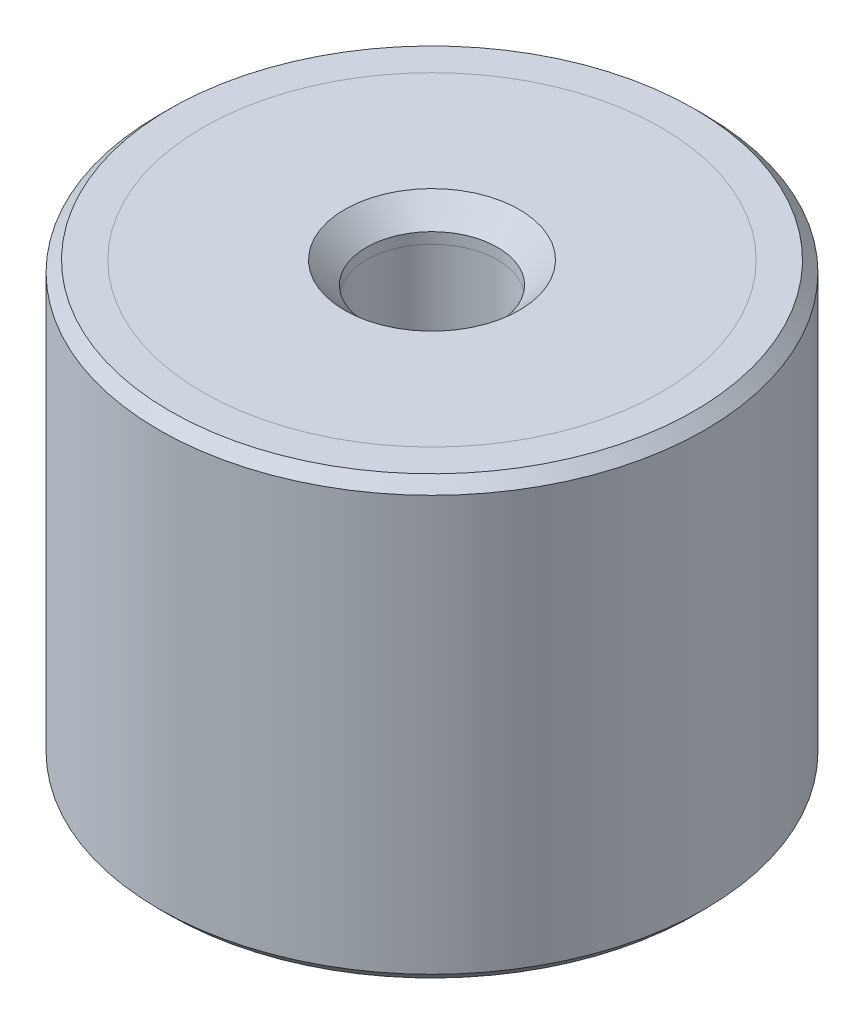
ISO-10303-21;
HEADER;
FILE_DESCRIPTION(('STEP AP214'),'2;1');
FILE_NAME('part.step','',(''),(''),'','','');
FILE_SCHEMA(('AUTOMOTIVE_DESIGN { 1 0 10303 214 1 1 1 1 }'));
ENDSEC;
DATA;
#1=APPLICATION_CONTEXT('core data for automotive mechanical design processes');
#2=APPLICATION_PROTOCOL_DEFINITION('international standard','automotive_design',2000,#1);
#3=PRODUCT_CONTEXT('',#1,'mechanical');
#4=PRODUCT('Part','Part','',(#3));
#5=PRODUCT_RELATED_PRODUCT_CATEGORY('part','',(#4));
#6=PRODUCT_DEFINITION_FORMATION('','',#4);
#7=PRODUCT_DEFINITION_CONTEXT('part definition',#1,'design');
#8=PRODUCT_DEFINITION('design','',#6,#7);
#9=PRODUCT_DEFINITION_SHAPE('','',#8);
#10=(LENGTH_UNIT() NAMED_UNIT(*) SI_UNIT(.MILLI.,.METRE.));
#11=(NAMED_UNIT(*) PLANE_ANGLE_UNIT() SI_UNIT($,.RADIAN.));
#12=(NAMED_UNIT(*) SI_UNIT($,.STERADIAN.) SOLID_ANGLE_UNIT());
#13=UNCERTAINTY_MEASURE_WITH_UNIT(LENGTH_MEASURE(1.E-05),#10,'distance_accuracy_value','');
#14=(GEOMETRIC_REPRESENTATION_CONTEXT(3) GLOBAL_UNCERTAINTY_ASSIGNED_CONTEXT((#13)) GLOBAL_UNIT_ASSIGNED_CONTEXT((#10,
#11,#12)) REPRESENTATION_CONTEXT('',''));
#15=CARTESIAN_POINT('',(0.,0.,0.));
#16=DIRECTION('',(0.,0.,1.));
#17=DIRECTION('',(1.,0.,0.));
#18=AXIS2_PLACEMENT_3D('',#15,#16,#17);
#19=CARTESIAN_POINT('',(0.,51.0340428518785,0.));
#20=DIRECTION('',(0.,1.,0.));
#21=DIRECTION('',(0.,0.,1.));
#22=AXIS2_PLACEMENT_3D('',#19,#20,#21);
#23=CYLINDRICAL_SURFACE('',#22,3.);
#24=CARTESIAN_POINT('',(0.,-17.5,0.));
#25=DIRECTION('',(0.,-1.,0.));
#26=DIRECTION('',(0.,0.,-1.));
#27=AXIS2_PLACEMENT_3D('',#24,#25,#26);
#28=CIRCLE('',#27,3.);
#29=CARTESIAN_POINT('',(0.,-17.5,-3.));
#30=VERTEX_POINT('',#29);
#31=EDGE_CURVE('P0_E10',#30,#30,#28,.T.);
#32=ORIENTED_EDGE('',*,*,#31,.T.);
#33=EDGE_LOOP('',(#32));
#34=FACE_BOUND('',#33,.T.);
#35=CARTESIAN_POINT('',(0.,-17.,0.));
#36=DIRECTION('',(0.,1.,0.));
#37=DIRECTION('',(0.,0.,1.));
#38=AXIS2_PLACEMENT_3D('',#35,#36,#37);
#39=CIRCLE('',#38,3.);
#40=CARTESIAN_POINT('',(0.,-17.,3.));
#41=VERTEX_POINT('',#40);
#42=EDGE_CURVE('P0_E25',#41,#41,#39,.T.);
#43=ORIENTED_EDGE('',*,*,#42,.T.);
#44=EDGE_LOOP('',(#43));
#45=FACE_BOUND('',#44,.T.);
#46=ADVANCED_FACE('P0_F14',(#34,#45),#23,.F.);
#47=CARTESIAN_POINT('',(0.,-17.,3.));
#48=DIRECTION('',(0.,1.,0.));
#49=DIRECTION('',(0.,0.,1.));
#50=AXIS2_PLACEMENT_3D('',#47,#48,#49);
#51=PLANE('',#50);
#52=CARTESIAN_POINT('',(0.,-17.,0.));
#53=DIRECTION('',(0.,1.,0.));
#54=DIRECTION('',(0.,0.,1.));
#55=AXIS2_PLACEMENT_3D('',#52,#53,#54);
#56=CIRCLE('',#55,10.5);
#57=CARTESIAN_POINT('',(0.,-17.,10.5));
#58=VERTEX_POINT('',#57);
#59=EDGE_CURVE('P0_E29',#58,#58,#56,.T.);
#60=ORIENTED_EDGE('',*,*,#59,.T.);
#61=EDGE_LOOP('',(#60));
#62=FACE_BOUND('',#61,.T.);
#63=ORIENTED_EDGE('',*,*,#42,.F.);
#64=EDGE_LOOP('',(#63));
#65=FACE_BOUND('',#64,.T.);
#66=ADVANCED_FACE('P0_F50',(#62,#65),#51,.T.);
#67=CARTESIAN_POINT('',(0.,51.0340428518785,0.));
#68=DIRECTION('',(0.,1.,0.));
#69=DIRECTION('',(0.,0.,1.));
#70=AXIS2_PLACEMENT_3D('',#67,#68,#69);
#71=CYLINDRICAL_SURFACE('',#70,10.5);
#72=CARTESIAN_POINT('',(0.,-18.5,0.));
#73=DIRECTION('',(0.,1.,0.));
#74=DIRECTION('',(0.,0.,1.));
#75=AXIS2_PLACEMENT_3D('',#72,#73,#74);
#76=CIRCLE('',#75,10.5);
#77=CARTESIAN_POINT('',(0.,-18.5,10.5));
#78=VERTEX_POINT('',#77);
#79=EDGE_CURVE('P0_E34',#78,#78,#76,.T.);
#80=ORIENTED_EDGE('',*,*,#79,.T.);
#81=EDGE_LOOP('',(#80));
#82=FACE_BOUND('',#81,.T.);
#83=ORIENTED_EDGE('',*,*,#59,.F.);
#84=EDGE_LOOP('',(#83));
#85=FACE_BOUND('',#84,.T.);
#86=ADVANCED_FACE('P0_F38',(#82,#85),#71,.T.);
#87=CARTESIAN_POINT('',(0.,-18.5,10.5));
#88=DIRECTION('',(0.,-1.,0.));
#89=DIRECTION('',(0.,0.,-1.));
#90=AXIS2_PLACEMENT_3D('',#87,#88,#89);
#91=PLANE('',#90);
#92=CARTESIAN_POINT('',(0.,-18.5,0.));
#93=DIRECTION('',(0.,-1.,0.));
#94=DIRECTION('',(0.,0.,-1.));
#95=AXIS2_PLACEMENT_3D('',#92,#93,#94);
#96=CIRCLE('',#95,4.);
#97=CARTESIAN_POINT('',(0.,-18.5,-4.));
#98=VERTEX_POINT('',#97);
#99=EDGE_CURVE('P0_E21',#98,#98,#96,.F.);
#100=ORIENTED_EDGE('',*,*,#99,.T.);
#101=EDGE_LOOP('',(#100));
#102=FACE_BOUND('',#101,.T.);
#103=ORIENTED_EDGE('',*,*,#79,.F.);
#104=EDGE_LOOP('',(#103));
#105=FACE_BOUND('',#104,.T.);
#106=ADVANCED_FACE('P0_F41',(#102,#105),#91,.T.);
#107=CARTESIAN_POINT('',(0.,-18.5,0.));
#108=DIRECTION('',(0.,-1.,0.));
#109=DIRECTION('',(0.,0.,-1.));
#110=AXIS2_PLACEMENT_3D('',#107,#108,#109);
#111=CONICAL_SURFACE('',#110,4.,0.785398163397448);
#112=ORIENTED_EDGE('',*,*,#31,.F.);
#113=EDGE_LOOP('',(#112));
#114=FACE_BOUND('',#113,.T.);
#115=ORIENTED_EDGE('',*,*,#99,.F.);
#116=EDGE_LOOP('',(#115));
#117=FACE_BOUND('',#116,.T.);
#118=ADVANCED_FACE('P0_F16',(#114,#117),#111,.F.);
#119=CLOSED_SHELL('',(#46,#66,#86,#106,#118));
#120=MANIFOLD_SOLID_BREP('P0_B1',#119);
#121=CARTESIAN_POINT('',(0.,69.5340428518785,0.));
#122=DIRECTION('',(0.,1.,0.));
#123=DIRECTION('',(0.,0.,1.));
#124=AXIS2_PLACEMENT_3D('',#121,#122,#123);
#125=CYLINDRICAL_SURFACE('',#124,3.);
#126=CARTESIAN_POINT('',(0.,0.5,0.));
#127=DIRECTION('',(0.,1.,0.));
#128=DIRECTION('',(0.,0.,1.));
#129=AXIS2_PLACEMENT_3D('',#126,#127,#128);
#130=CIRCLE('',#129,3.);
#131=CARTESIAN_POINT('',(0.,0.5,3.));
#132=VERTEX_POINT('',#131);
#133=EDGE_CURVE('P1_E21',#132,#132,#130,.T.);
#134=ORIENTED_EDGE('',*,*,#133,.T.);
#135=EDGE_LOOP('',(#134));
#136=FACE_BOUND('',#135,.T.);
#137=CARTESIAN_POINT('',(0.,0.,0.));
#138=DIRECTION('',(0.,1.,0.));
#139=DIRECTION('',(0.,0.,1.));
#140=AXIS2_PLACEMENT_3D('',#137,#138,#139);
#141=CIRCLE('',#140,3.);
#142=CARTESIAN_POINT('',(0.,0.,3.));
#143=VERTEX_POINT('',#142);
#144=EDGE_CURVE('P1_E34',#143,#143,#141,.T.);
#145=ORIENTED_EDGE('',*,*,#144,.F.);
#146=EDGE_LOOP('',(#145));
#147=FACE_BOUND('',#146,.T.);
#148=ADVANCED_FACE('P1_F14',(#136,#147),#125,.F.);
#149=CARTESIAN_POINT('',(0.,1.5,3.));
#150=DIRECTION('',(0.,1.,0.));
#151=DIRECTION('',(0.,0.,1.));
#152=AXIS2_PLACEMENT_3D('',#149,#150,#151);
#153=PLANE('',#152);
#154=CARTESIAN_POINT('',(0.,1.5,0.));
#155=DIRECTION('',(0.,1.,0.));
#156=DIRECTION('',(0.,0.,1.));
#157=AXIS2_PLACEMENT_3D('',#154,#155,#156);
#158=CIRCLE('',#157,4.);
#159=CARTESIAN_POINT('',(0.,1.5,4.));
#160=VERTEX_POINT('',#159);
#161=EDGE_CURVE('P1_E10',#160,#160,#158,.F.);
#162=ORIENTED_EDGE('',*,*,#161,.T.);
#163=EDGE_LOOP('',(#162));
#164=FACE_BOUND('',#163,.T.);
#165=CARTESIAN_POINT('',(0.,1.5,0.));
#166=DIRECTION('',(0.,1.,0.));
#167=DIRECTION('',(0.,0.,1.));
#168=AXIS2_PLACEMENT_3D('',#165,#166,#167);
#169=CIRCLE('',#168,10.5);
#170=CARTESIAN_POINT('',(0.,1.5,10.5));
#171=VERTEX_POINT('',#170);
#172=EDGE_CURVE('P1_E25',#171,#171,#169,.T.);
#173=ORIENTED_EDGE('',*,*,#172,.T.);
#174=EDGE_LOOP('',(#173));
#175=FACE_BOUND('',#174,.T.);
#176=ADVANCED_FACE('P1_F42',(#164,#175),#153,.T.);
#177=CARTESIAN_POINT('',(0.,69.5340428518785,0.));
#178=DIRECTION('',(0.,1.,0.));
#179=DIRECTION('',(0.,0.,1.));
#180=AXIS2_PLACEMENT_3D('',#177,#178,#179);
#181=CYLINDRICAL_SURFACE('',#180,10.5);
#182=CARTESIAN_POINT('',(0.,0.,0.));
#183=DIRECTION('',(0.,1.,0.));
#184=DIRECTION('',(0.,0.,1.));
#185=AXIS2_PLACEMENT_3D('',#182,#183,#184);
#186=CIRCLE('',#185,10.5);
#187=CARTESIAN_POINT('',(0.,0.,10.5));
#188=VERTEX_POINT('',#187);
#189=EDGE_CURVE('P1_E29',#188,#188,#186,.T.);
#190=ORIENTED_EDGE('',*,*,#189,.T.);
#191=EDGE_LOOP('',(#190));
#192=FACE_BOUND('',#191,.T.);
#193=ORIENTED_EDGE('',*,*,#172,.F.);
#194=EDGE_LOOP('',(#193));
#195=FACE_BOUND('',#194,.T.);
#196=ADVANCED_FACE('P1_F47',(#192,#195),#181,.T.);
#197=CARTESIAN_POINT('',(0.,0.,10.5));
#198=DIRECTION('',(0.,-1.,0.));
#199=DIRECTION('',(0.,0.,-1.));
#200=AXIS2_PLACEMENT_3D('',#197,#198,#199);
#201=PLANE('',#200);
#202=ORIENTED_EDGE('',*,*,#144,.T.);
#203=EDGE_LOOP('',(#202));
#204=FACE_BOUND('',#203,.T.);
#205=ORIENTED_EDGE('',*,*,#189,.F.);
#206=EDGE_LOOP('',(#205));
#207=FACE_BOUND('',#206,.T.);
#208=ADVANCED_FACE('P1_F38',(#204,#207),#201,.T.);
#209=CARTESIAN_POINT('',(0.,0.5,0.));
#210=DIRECTION('',(0.,1.,0.));
#211=DIRECTION('',(0.,0.,1.));
#212=AXIS2_PLACEMENT_3D('',#209,#210,#211);
#213=CONICAL_SURFACE('',#212,3.,0.78539816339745);
#214=ORIENTED_EDGE('',*,*,#161,.F.);
#215=EDGE_LOOP('',(#214));
#216=FACE_BOUND('',#215,.T.);
#217=ORIENTED_EDGE('',*,*,#133,.F.);
#218=EDGE_LOOP('',(#217));
#219=FACE_BOUND('',#218,.T.);
#220=ADVANCED_FACE('P1_F16',(#216,#219),#213,.F.);
#221=CLOSED_SHELL('',(#148,#176,#196,#208,#220));
#222=MANIFOLD_SOLID_BREP('P1_B1',#221);
#223=CARTESIAN_POINT('',(0.,0.,0.));
#224=DIRECTION('',(0.,1.,0.));
#225=DIRECTION('',(0.,0.,1.));
#226=AXIS2_PLACEMENT_3D('',#223,#224,#225);
#227=PLANE('',#226);
#228=CARTESIAN_POINT('',(0.,0.,0.));
#229=DIRECTION('',(0.,1.,0.));
#230=DIRECTION('',(0.,0.,1.));
#231=AXIS2_PLACEMENT_3D('',#228,#229,#230);
#232=CIRCLE('',#231,3.);
#233=CARTESIAN_POINT('',(0.,0.,3.));
#234=VERTEX_POINT('',#233);
#235=EDGE_CURVE('P2_E46',#234,#234,#232,.T.);
#236=ORIENTED_EDGE('',*,*,#235,.F.);
#237=EDGE_LOOP('',(#236));
#238=FACE_BOUND('',#237,.T.);
#239=CARTESIAN_POINT('',(0.,0.,0.));
#240=DIRECTION('',(0.,1.,0.));
#241=DIRECTION('',(0.,0.,1.));
#242=AXIS2_PLACEMENT_3D('',#239,#240,#241);
#243=CIRCLE('',#242,10.5);
#244=CARTESIAN_POINT('',(0.,0.,10.5));
#245=VERTEX_POINT('',#244);
#246=EDGE_CURVE('P2_E33',#245,#245,#243,.T.);
#247=ORIENTED_EDGE('',*,*,#246,.T.);
#248=EDGE_LOOP('',(#247));
#249=FACE_BOUND('',#248,.T.);
#250=ADVANCED_FACE('P2_F13',(#238,#249),#227,.T.);
#251=CARTESIAN_POINT('',(0.,65.5134936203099,0.));
#252=DIRECTION('',(0.,1.,0.));
#253=DIRECTION('',(0.,0.,1.));
#254=AXIS2_PLACEMENT_3D('',#251,#252,#253);
#255=CYLINDRICAL_SURFACE('',#254,10.5);
#256=CARTESIAN_POINT('',(0.,1.5,0.));
#257=DIRECTION('',(0.,1.,0.));
#258=DIRECTION('',(0.,0.,1.));
#259=AXIS2_PLACEMENT_3D('',#256,#257,#258);
#260=CIRCLE('',#259,10.5);
#261=CARTESIAN_POINT('',(0.,1.5,10.5));
#262=VERTEX_POINT('',#261);
#263=EDGE_CURVE('P2_E36',#262,#262,#260,.T.);
#264=ORIENTED_EDGE('',*,*,#263,.T.);
#265=EDGE_LOOP('',(#264));
#266=FACE_BOUND('',#265,.T.);
#267=ORIENTED_EDGE('',*,*,#246,.F.);
#268=EDGE_LOOP('',(#267));
#269=FACE_BOUND('',#268,.T.);
#270=ADVANCED_FACE('P2_F92',(#266,#269),#255,.F.);
#271=CARTESIAN_POINT('',(0.,1.5,10.5));
#272=DIRECTION('',(0.,1.,0.));
#273=DIRECTION('',(0.,0.,1.));
#274=AXIS2_PLACEMENT_3D('',#271,#272,#273);
#275=PLANE('',#274);
#276=CARTESIAN_POINT('',(0.,1.5,0.));
#277=DIRECTION('',(0.,1.,0.));
#278=DIRECTION('',(0.,0.,1.));
#279=AXIS2_PLACEMENT_3D('',#276,#277,#278);
#280=CIRCLE('',#279,12.);
#281=CARTESIAN_POINT('',(0.,1.5,12.));
#282=VERTEX_POINT('',#281);
#283=EDGE_CURVE('P2_E9',#282,#282,#280,.T.);
#284=ORIENTED_EDGE('',*,*,#283,.T.);
#285=EDGE_LOOP('',(#284));
#286=FACE_BOUND('',#285,.T.);
#287=ORIENTED_EDGE('',*,*,#263,.F.);
#288=EDGE_LOOP('',(#287));
#289=FACE_BOUND('',#288,.T.);
#290=ADVANCED_FACE('P2_F88',(#286,#289),#275,.T.);
#291=CARTESIAN_POINT('',(0.,65.5134936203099,0.));
#292=DIRECTION('',(0.,1.,0.));
#293=DIRECTION('',(0.,0.,1.));
#294=AXIS2_PLACEMENT_3D('',#291,#292,#293);
#295=CYLINDRICAL_SURFACE('',#294,12.5);
#296=CARTESIAN_POINT('',(0.,-18.,0.));
#297=DIRECTION('',(0.,-1.,0.));
#298=DIRECTION('',(0.,0.,-1.));
#299=AXIS2_PLACEMENT_3D('',#296,#297,#298);
#300=CIRCLE('',#299,12.5);
#301=CARTESIAN_POINT('',(0.,-18.,-12.5));
#302=VERTEX_POINT('',#301);
#303=EDGE_CURVE('P2_E24',#302,#302,#300,.F.);
#304=ORIENTED_EDGE('',*,*,#303,.T.);
#305=EDGE_LOOP('',(#304));
#306=FACE_BOUND('',#305,.T.);
#307=CARTESIAN_POINT('',(0.,1.,0.));
#308=DIRECTION('',(0.,1.,0.));
#309=DIRECTION('',(0.,0.,1.));
#310=AXIS2_PLACEMENT_3D('',#307,#308,#309);
#311=CIRCLE('',#310,12.5);
#312=CARTESIAN_POINT('',(0.,1.,12.5));
#313=VERTEX_POINT('',#312);
#314=EDGE_CURVE('P2_E28',#313,#313,#311,.F.);
#315=ORIENTED_EDGE('',*,*,#314,.T.);
#316=EDGE_LOOP('',(#315));
#317=FACE_BOUND('',#316,.T.);
#318=ADVANCED_FACE('P2_F82',(#306,#317),#295,.T.);
#319=CARTESIAN_POINT('',(0.,-18.5,12.5));
#320=DIRECTION('',(0.,-1.,0.));
#321=DIRECTION('',(0.,0.,-1.));
#322=AXIS2_PLACEMENT_3D('',#319,#320,#321);
#323=PLANE('',#322);
#324=CARTESIAN_POINT('',(0.,-18.5,0.));
#325=DIRECTION('',(0.,-1.,0.));
#326=DIRECTION('',(0.,0.,-1.));
#327=AXIS2_PLACEMENT_3D('',#324,#325,#326);
#328=CIRCLE('',#327,12.);
#329=CARTESIAN_POINT('',(0.,-18.5,-12.));
#330=VERTEX_POINT('',#329);
#331=EDGE_CURVE('P2_E20',#330,#330,#328,.T.);
#332=ORIENTED_EDGE('',*,*,#331,.T.);
#333=EDGE_LOOP('',(#332));
#334=FACE_BOUND('',#333,.T.);
#335=CARTESIAN_POINT('',(0.,-18.5,0.));
#336=DIRECTION('',(0.,1.,0.));
#337=DIRECTION('',(0.,0.,1.));
#338=AXIS2_PLACEMENT_3D('',#335,#336,#337);
#339=CIRCLE('',#338,10.5);
#340=CARTESIAN_POINT('',(0.,-18.5,10.5));
#341=VERTEX_POINT('',#340);
#342=EDGE_CURVE('P2_E39',#341,#341,#339,.T.);
#343=ORIENTED_EDGE('',*,*,#342,.T.);
#344=EDGE_LOOP('',(#343));
#345=FACE_BOUND('',#344,.T.);
#346=ADVANCED_FACE('P2_F77',(#334,#345),#323,.T.);
#347=CARTESIAN_POINT('',(0.,65.5134936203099,0.));
#348=DIRECTION('',(0.,1.,0.));
#349=DIRECTION('',(0.,0.,1.));
#350=AXIS2_PLACEMENT_3D('',#347,#348,#349);
#351=CYLINDRICAL_SURFACE('',#350,10.5);
#352=CARTESIAN_POINT('',(0.,-17.,0.));
#353=DIRECTION('',(0.,1.,0.));
#354=DIRECTION('',(0.,0.,1.));
#355=AXIS2_PLACEMENT_3D('',#352,#353,#354);
#356=CIRCLE('',#355,10.5);
#357=CARTESIAN_POINT('',(0.,-17.,10.5));
#358=VERTEX_POINT('',#357);
#359=EDGE_CURVE('P2_E42',#358,#358,#356,.T.);
#360=ORIENTED_EDGE('',*,*,#359,.T.);
#361=EDGE_LOOP('',(#360));
#362=FACE_BOUND('',#361,.T.);
#363=ORIENTED_EDGE('',*,*,#342,.F.);
#364=EDGE_LOOP('',(#363));
#365=FACE_BOUND('',#364,.T.);
#366=ADVANCED_FACE('P2_F71',(#362,#365),#351,.F.);
#367=CARTESIAN_POINT('',(0.,-17.,10.5));
#368=DIRECTION('',(0.,-1.,0.));
#369=DIRECTION('',(0.,0.,-1.));
#370=AXIS2_PLACEMENT_3D('',#367,#368,#369);
#371=PLANE('',#370);
#372=CARTESIAN_POINT('',(0.,-17.,0.));
#373=DIRECTION('',(0.,-1.,0.));
#374=DIRECTION('',(0.,0.,-1.));
#375=AXIS2_PLACEMENT_3D('',#372,#373,#374);
#376=CIRCLE('',#375,3.);
#377=CARTESIAN_POINT('',(0.,-17.,-3.));
#378=VERTEX_POINT('',#377);
#379=EDGE_CURVE('P2_E52',#378,#378,#376,.T.);
#380=ORIENTED_EDGE('',*,*,#379,.F.);
#381=EDGE_LOOP('',(#380));
#382=FACE_BOUND('',#381,.T.);
#383=ORIENTED_EDGE('',*,*,#359,.F.);
#384=EDGE_LOOP('',(#383));
#385=FACE_BOUND('',#384,.T.);
#386=ADVANCED_FACE('P2_F67',(#382,#385),#371,.T.);
#387=CARTESIAN_POINT('',(0.,-18.,0.));
#388=DIRECTION('',(0.,1.,0.));
#389=DIRECTION('',(0.,0.,1.));
#390=AXIS2_PLACEMENT_3D('',#387,#388,#389);
#391=CONICAL_SURFACE('',#390,12.5,0.78539816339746);
#392=ORIENTED_EDGE('',*,*,#331,.F.);
#393=EDGE_LOOP('',(#392));
#394=FACE_BOUND('',#393,.T.);
#395=ORIENTED_EDGE('',*,*,#303,.F.);
#396=EDGE_LOOP('',(#395));
#397=FACE_BOUND('',#396,.T.);
#398=ADVANCED_FACE('P2_F70',(#394,#397),#391,.T.);
#399=CARTESIAN_POINT('',(0.,1.5,0.));
#400=DIRECTION('',(0.,-1.,0.));
#401=DIRECTION('',(0.,0.,-1.));
#402=AXIS2_PLACEMENT_3D('',#399,#400,#401);
#403=CONICAL_SURFACE('',#402,12.,0.785398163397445);
#404=ORIENTED_EDGE('',*,*,#314,.F.);
#405=EDGE_LOOP('',(#404));
#406=FACE_BOUND('',#405,.T.);
#407=ORIENTED_EDGE('',*,*,#283,.F.);
#408=EDGE_LOOP('',(#407));
#409=FACE_BOUND('',#408,.T.);
#410=ADVANCED_FACE('P2_F15',(#406,#409),#403,.T.);
#411=CARTESIAN_POINT('',(0.,-4.5,0.));
#412=DIRECTION('',(0.,1.,0.));
#413=DIRECTION('',(0.,0.,1.));
#414=AXIS2_PLACEMENT_3D('',#411,#412,#413);
#415=CYLINDRICAL_SURFACE('',#414,3.);
#416=CARTESIAN_POINT('',(0.,-4.5,0.));
#417=DIRECTION('',(0.,1.,0.));
#418=DIRECTION('',(0.,0.,1.));
#419=AXIS2_PLACEMENT_3D('',#416,#417,#418);
#420=CIRCLE('',#419,3.);
#421=CARTESIAN_POINT('',(0.,-4.5,3.));
#422=VERTEX_POINT('',#421);
#423=EDGE_CURVE('P2_E45',#422,#422,#420,.T.);
#424=ORIENTED_EDGE('',*,*,#423,.F.);
#425=EDGE_LOOP('',(#424));
#426=FACE_BOUND('',#425,.T.);
#427=ORIENTED_EDGE('',*,*,#235,.T.);
#428=EDGE_LOOP('',(#427));
#429=FACE_BOUND('',#428,.T.);
#430=ADVANCED_FACE('P2_F108',(#426,#429),#415,.F.);
#431=CARTESIAN_POINT('',(0.,-4.5,0.));
#432=DIRECTION('',(0.,1.,0.));
#433=DIRECTION('',(0.,0.,1.));
#434=AXIS2_PLACEMENT_3D('',#431,#432,#433);
#435=PLANE('',#434);
#436=ORIENTED_EDGE('',*,*,#423,.T.);
#437=EDGE_LOOP('',(#436));
#438=FACE_BOUND('',#437,.T.);
#439=ADVANCED_FACE('P2_F63',(#438),#435,.T.);
#440=CARTESIAN_POINT('',(0.,-12.5,0.));
#441=DIRECTION('',(0.,-1.,0.));
#442=DIRECTION('',(0.,0.,-1.));
#443=AXIS2_PLACEMENT_3D('',#440,#441,#442);
#444=CYLINDRICAL_SURFACE('',#443,3.);
#445=CARTESIAN_POINT('',(0.,-12.5,0.));
#446=DIRECTION('',(0.,-1.,0.));
#447=DIRECTION('',(0.,0.,-1.));
#448=AXIS2_PLACEMENT_3D('',#445,#446,#447);
#449=CIRCLE('',#448,3.);
#450=CARTESIAN_POINT('',(0.,-12.5,-3.));
#451=VERTEX_POINT('',#450);
#452=EDGE_CURVE('P2_E49',#451,#451,#449,.T.);
#453=ORIENTED_EDGE('',*,*,#452,.F.);
#454=EDGE_LOOP('',(#453));
#455=FACE_BOUND('',#454,.T.);
#456=ORIENTED_EDGE('',*,*,#379,.T.);
#457=EDGE_LOOP('',(#456));
#458=FACE_BOUND('',#457,.T.);
#459=ADVANCED_FACE('P2_F60',(#455,#458),#444,.F.);
#460=CARTESIAN_POINT('',(0.,-12.5,0.));
#461=DIRECTION('',(0.,-1.,0.));
#462=DIRECTION('',(0.,0.,-1.));
#463=AXIS2_PLACEMENT_3D('',#460,#461,#462);
#464=PLANE('',#463);
#465=ORIENTED_EDGE('',*,*,#452,.T.);
#466=EDGE_LOOP('',(#465));
#467=FACE_BOUND('',#466,.T.);
#468=ADVANCED_FACE('P2_F58',(#467),#464,.T.);
#469=CLOSED_SHELL('',(#250,#270,#290,#318,#346,#366,#386,#398,#410,#430,#439,#459,#468));
#470=MANIFOLD_SOLID_BREP('P2_B1',#469);
#471=ADVANCED_BREP_SHAPE_REPRESENTATION('',(#18,#120,#222,#470),#14);
#472=SHAPE_DEFINITION_REPRESENTATION(#9,#471);
ENDSEC;
END-ISO-10303-21;
